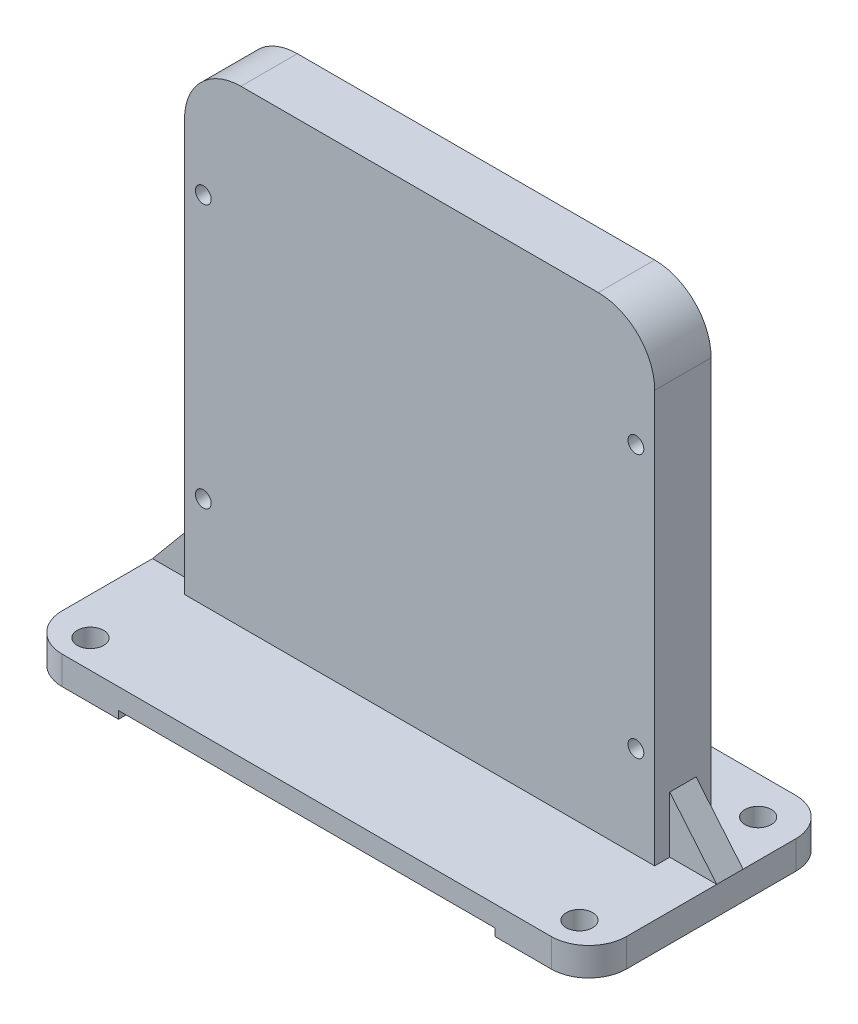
from build123d import *

# Parameters (mm, degrees)
EXTRUDE_1_DEPTH     = 7.5
SKETCH_2_W          = 150
SKETCH_2_H          = 65
EXTRUDE_2_DEPTH     = 7.5
RIB_1_REACH         = 108.711
SKETCH_3_WALL_W     = 234.947741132
SKETCH_3_WALL_H     = 7
M8X1_0_1_AT_2_COUNT = 2
M8X1_0_1_AT_2_PITCH = 47.5
FILLET_1_R          = 10
HOLE_WIZARD_M5_1_D  = 4.2
SKETCH_9_W          = 100
SKETCH_9_H          = 4
CUT_EXTRUDE_1_DEPTH = 120.18892566


with BuildPart() as part:
    # Sketch 1 → Extrude 1 (new, symmetric)
    with BuildSketch(Plane.XY):
        with BuildLine():
            Line((47.5, 66), (-47.5, 66))
            ThreePointArc((-47.5, 66), (-58.106601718, 61.606601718), (-62.5, 51))
            Line((-62.5, 51), (-62.5, -66))
            Line((-62.5, -66), (62.5, -66))
            Line((62.5, -66), (62.5, 51))
            ThreePointArc((62.5, 51), (58.106601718, 61.606601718), (47.5, 66))
        make_face()
    extrude(amount=EXTRUDE_1_DEPTH, both=True)

    # Sketch 2 → Extrude 2 (add)
    with BuildSketch(Plane.XZ.offset(66)):
        with Locations((0, 5)):
            Rectangle(SKETCH_2_W, SKETCH_2_H)
    extrude(amount=-EXTRUDE_2_DEPTH)

    # Sketch 3 wall → Rib 1 (add, up to next)
    with BuildSketch(Plane(origin=(-68.75, -51, 0), x_dir=(0.640184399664, 0.768221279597, 0), z_dir=(-0.768221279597, 0.640184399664, 0)), mode=Mode.PRIVATE) as rib_1_sk1:
        Rectangle(SKETCH_3_WALL_W, SKETCH_3_WALL_H)
    rib_1_tool1 = extrude(rib_1_sk1.sketch, amount=-RIB_1_REACH, mode=Mode.PRIVATE) - part.part
    rib_1 = rib_1_tool1.solids().sort_by_distance((-68.75, -51, 0))[0]
    add(rib_1)

    # Mirror 1: Rib 1 across plane
    add(rib_1.mirror(Plane(origin=(0, 0, 0), x_dir=(0, 0, 1), z_dir=(1, 0, 0))))

    # Sketch 5 → M8x1.0 _1 (revolve, cut)
    with BuildSketch(Plane(origin=(-65, -58.5, -17.5), x_dir=(0, 0, 1), z_dir=(1, 0, 0))):
        Polygon((0, 0), (0, 21.103012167), (3.5, 19), (3.5, 0), align=None)
    m8x1_0_1 = revolve(axis=Axis((-65, -52.15, -17.5), (0, -1, 0)), mode=Mode.SUBTRACT)

    # M8x1.0 _1 at 2: M8x1.0 _1 ×2
    with Locations(*[(0, 0, i * M8X1_0_1_AT_2_PITCH) for i in range(1, M8X1_0_1_AT_2_COUNT)]):
        add(m8x1_0_1, mode=Mode.SUBTRACT)

    # Mirror 2: M8x1.0 _1 across plane
    add(m8x1_0_1.mirror(Plane(origin=(0, 0, 0), x_dir=(0, 0, 1), z_dir=(1, 0, 0))), mode=Mode.SUBTRACT)

    # Mirror 2 copy 1 sketch → Mirror 2 copy 1 (revolve, cut)
    with BuildSketch(Plane(origin=(65, -58.5, 30), x_dir=(0, 0, 1), z_dir=(-1, 0, 0))):
        Polygon((0, 0), (0, -21.103012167), (3.5, -19), (3.5, 0), align=None)
    revolve(axis=Axis((65, -52.15, 30), (0, 1, 0)), mode=Mode.SUBTRACT)

    # Fillet 1
    fillet_1_edges = [part.edges().sort_by_distance(p)[0] for p in [
        (-75, -62.25, -27.5),
        (-75, -62.25, 37.5),
        (75, -62.25, 37.5),
        (75, -62.25, -27.5),
    ]]
    fillet(fillet_1_edges, radius=FILLET_1_R)

    # Hole Wizard M5 _1 (through all)
    with Locations(Plane(origin=(-57.5, 36, 7.5), x_dir=(1, 0, 0), z_dir=(0, 0, 1))):
        with Locations((0, 0), (115, 0), (115, -70), (0, -70)):
            Hole(HOLE_WIZARD_M5_1_D / 2)

    # Sketch 9 → Cut-Extrude 1 (cut, through all)
    with BuildSketch(Plane.XY.offset(37.5)):
        with Locations((0, -66)):
            Rectangle(SKETCH_9_W, SKETCH_9_H)
    extrude(amount=-CUT_EXTRUDE_1_DEPTH, mode=Mode.SUBTRACT)


solid = part.part
